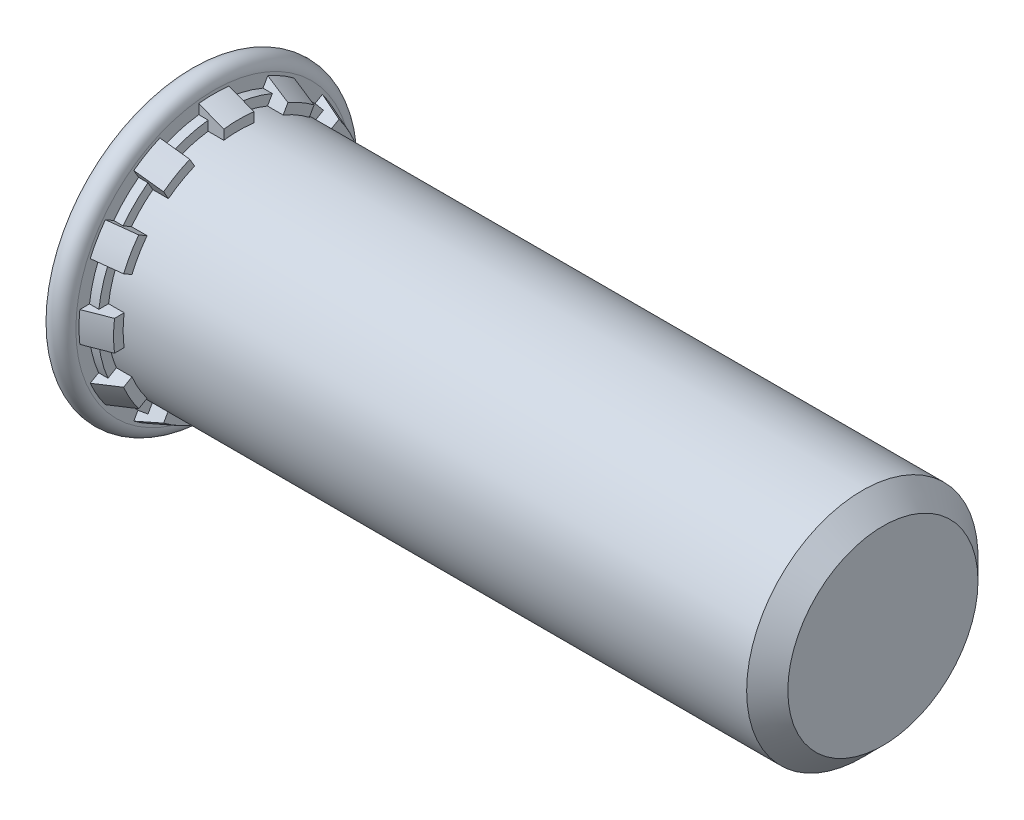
from build123d import *

# Parameters (mm, degrees)
RIBCUT1_DEPTH    = 0.3375
RIBCUT2_DEPTH    = 0.54
RIBCUTSPAT_COUNT = 12
RIBCUTSPAT_ANGLE = 330


with BuildPart() as part:
    # BodySke → BaseBody (revolve)
    with BuildSketch(Plane.XY, mode=Mode.PRIVATE) as basebody_sk:
        with BuildLine():
            Line((0, 0), (0, 2.97746))
            Line((0, 2.97746), (0.00508, 2.97746))
            Line((0.00508, 2.97746), (0.00508, 2.98254))
            ThreePointArc((0.00508, 2.98254), (0.27254, 3.25), (0.54, 2.98254))
            Line((0.54, 2.98254), (0.54, 2.915))
            Line((0.54, 2.915), (1.08, 2.7075))
            Line((1.08, 2.7075), (1.08, 2.5))
            Line((1.08, 2.5), (14.555, 2.5))
            Line((14.555, 2.5), (15, 2.055))
            Line((15, 2.055), (15, 0))
            Line((15, 0), (0, 0))
        make_face()
    revolve(basebody_sk.sketch.rotate(Axis((0, 0, 0), (1, 0, 0)), 90), axis=Axis((0, 0, 0), (1, 0, 0)))

    # RibCut1Ske → RibCut1 (cut)
    with BuildSketch(Plane(origin=(1.08, 0, 0), x_dir=(0, 0, -1), z_dir=(1, 0, 0))):
        with BuildLine():
            Line((0.326315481, 2.478612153), (0.326315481, 3.23357669))
            ThreePointArc((0.326315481, 3.23357669), (0.841161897, 3.139258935), (1.334190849, 2.963517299))
            Line((1.334190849, 2.963517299), (0.956708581, 2.309698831))
            ThreePointArc((0.956708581, 2.309698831), (0.647047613, 2.414814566), (0.326315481, 2.478612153))
        make_face()
    ribcut1 = extrude(amount=-RIBCUT1_DEPTH, mode=Mode.SUBTRACT)

    # RibCut2Ske → RibCut2 (cut)
    with BuildSketch(Plane(origin=(1.08, 0, 0), x_dir=(0, 0, -1), z_dir=(1, 0, 0))):
        with BuildLine():
            Line((0.326315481, 2.68776384), (0.326315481, 3.23357669))
            ThreePointArc((0.326315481, 3.23357669), (0.841161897, 3.139258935), (1.334190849, 2.963517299))
            Line((1.334190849, 2.963517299), (1.061284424, 2.490829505))
            ThreePointArc((1.061284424, 2.490829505), (0.700752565, 2.615244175), (0.326315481, 2.68776384))
        make_face()
    ribcut2 = extrude(amount=-RIBCUT2_DEPTH, mode=Mode.SUBTRACT)

    # RibCutsPat: RibCut1, RibCut2 ×12 about axis
    ribcutspat_axis = Axis((0, 0, 0), (1, 0, 0))
    add([ribcut1.rotate(ribcutspat_axis, i * RIBCUTSPAT_ANGLE / (RIBCUTSPAT_COUNT - 1)) for i in range(1, RIBCUTSPAT_COUNT)], mode=Mode.SUBTRACT)
    add([ribcut2.rotate(ribcutspat_axis, i * RIBCUTSPAT_ANGLE / (RIBCUTSPAT_COUNT - 1)) for i in range(1, RIBCUTSPAT_COUNT)], mode=Mode.SUBTRACT)


solid = part.part
